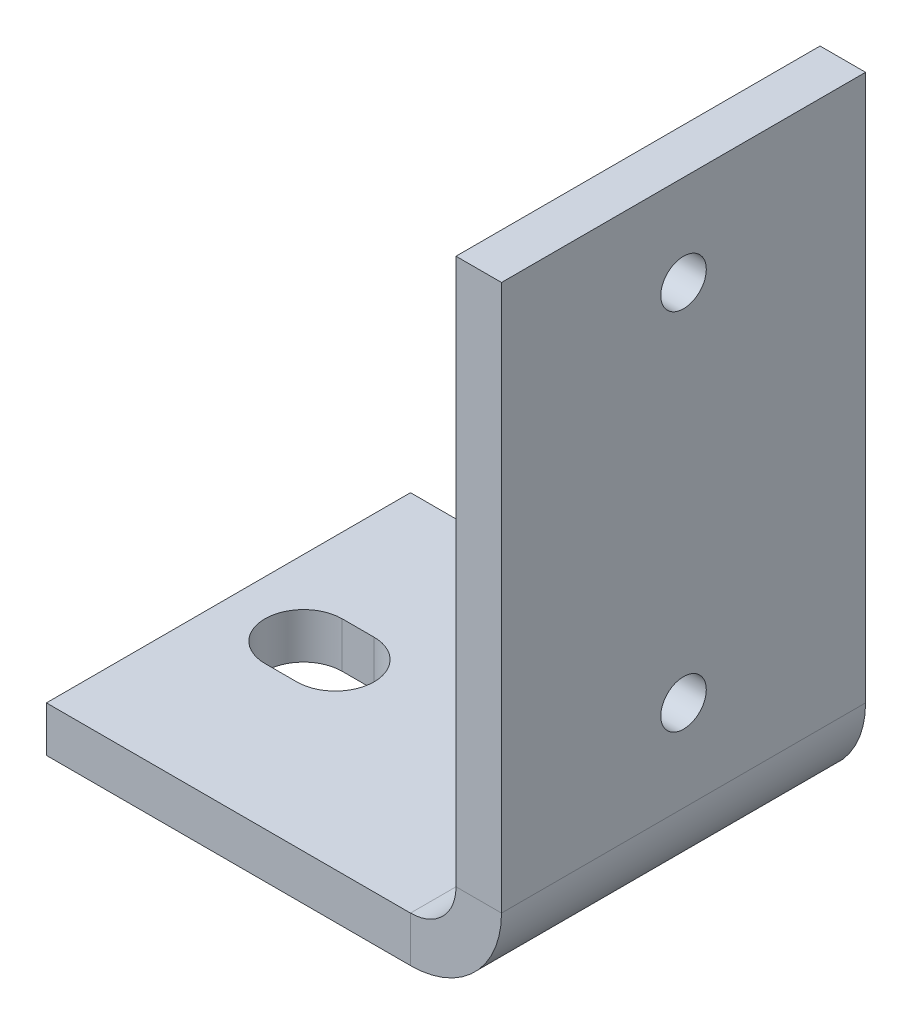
ISO-10303-21;
HEADER;
FILE_DESCRIPTION(('STEP AP214'),'2;1');
FILE_NAME('part.step','',(''),(''),'','','');
FILE_SCHEMA(('AUTOMOTIVE_DESIGN { 1 0 10303 214 1 1 1 1 }'));
ENDSEC;
DATA;
#1=APPLICATION_CONTEXT('core data for automotive mechanical design processes');
#2=APPLICATION_PROTOCOL_DEFINITION('international standard','automotive_design',2000,#1);
#3=PRODUCT_CONTEXT('',#1,'mechanical');
#4=PRODUCT('Part','Part','',(#3));
#5=PRODUCT_RELATED_PRODUCT_CATEGORY('part','',(#4));
#6=PRODUCT_DEFINITION_FORMATION('','',#4);
#7=PRODUCT_DEFINITION_CONTEXT('part definition',#1,'design');
#8=PRODUCT_DEFINITION('design','',#6,#7);
#9=PRODUCT_DEFINITION_SHAPE('','',#8);
#10=(LENGTH_UNIT() NAMED_UNIT(*) SI_UNIT(.MILLI.,.METRE.));
#11=(NAMED_UNIT(*) PLANE_ANGLE_UNIT() SI_UNIT($,.RADIAN.));
#12=(NAMED_UNIT(*) SI_UNIT($,.STERADIAN.) SOLID_ANGLE_UNIT());
#13=UNCERTAINTY_MEASURE_WITH_UNIT(LENGTH_MEASURE(1.E-05),#10,'distance_accuracy_value','');
#14=(GEOMETRIC_REPRESENTATION_CONTEXT(3) GLOBAL_UNCERTAINTY_ASSIGNED_CONTEXT((#13)) GLOBAL_UNIT_ASSIGNED_CONTEXT((#10,
#11,#12)) REPRESENTATION_CONTEXT('',''));
#15=CARTESIAN_POINT('',(0.,0.,0.));
#16=DIRECTION('',(0.,0.,1.));
#17=DIRECTION('',(1.,0.,0.));
#18=AXIS2_PLACEMENT_3D('',#15,#16,#17);
#19=CARTESIAN_POINT('',(-9.99999999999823,-70.0000000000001,20.0000000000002));
#20=DIRECTION('',(0.,0.,1.00000000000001));
#21=DIRECTION('',(1.,0.,0.));
#22=AXIS2_PLACEMENT_3D('',#19,#20,#21);
#23=PLANE('',#22);
#24=DIRECTION('',(0.,1.00000000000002,0.));
#25=VECTOR('',#24,1.);
#26=CARTESIAN_POINT('',(-9.99999999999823,-70.0000000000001,20.0000000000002));
#27=LINE('',#26,#25);
#28=CARTESIAN_POINT('',(-9.99999999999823,-70.0000000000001,20.0000000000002));
#29=VERTEX_POINT('',#28);
#30=CARTESIAN_POINT('',(-9.9999999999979,-64.9999999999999,20.0000000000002));
#31=VERTEX_POINT('',#30);
#32=EDGE_CURVE('E11',#29,#31,#27,.T.);
#33=ORIENTED_EDGE('',*,*,#32,.F.);
#34=CARTESIAN_POINT('',(-9.9999999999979,-60.0000000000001,20.0000000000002));
#35=DIRECTION('',(0.,0.,1.00000000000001));
#36=DIRECTION('',(1.,0.,0.));
#37=AXIS2_PLACEMENT_3D('',#34,#35,#36);
#38=CIRCLE('',#37,10.);
#39=CARTESIAN_POINT('',(2.1094237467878E-12,-60.0000000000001,20.0000000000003));
#40=VERTEX_POINT('',#39);
#41=EDGE_CURVE('E227',#40,#29,#38,.F.);
#42=ORIENTED_EDGE('',*,*,#41,.F.);
#43=DIRECTION('',(1.,0.,0.));
#44=VECTOR('',#43,1.);
#45=CARTESIAN_POINT('',(-4.9999999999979,-60.0000000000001,20.0000000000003));
#46=LINE('',#45,#44);
#47=CARTESIAN_POINT('',(-4.9999999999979,-60.0000000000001,20.0000000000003));
#48=VERTEX_POINT('',#47);
#49=EDGE_CURVE('E55',#48,#40,#46,.T.);
#50=ORIENTED_EDGE('',*,*,#49,.F.);
#51=CARTESIAN_POINT('',(-9.9999999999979,-60.0000000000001,20.0000000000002));
#52=DIRECTION('',(0.,0.,1.00000000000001));
#53=DIRECTION('',(1.,0.,0.));
#54=AXIS2_PLACEMENT_3D('',#51,#52,#53);
#55=CIRCLE('',#54,5.);
#56=EDGE_CURVE('E243',#48,#31,#55,.F.);
#57=ORIENTED_EDGE('',*,*,#56,.T.);
#58=EDGE_LOOP('',(#33,#42,#50,#57));
#59=FACE_BOUND('',#58,.T.);
#60=ADVANCED_FACE('F46',(#59),#23,.T.);
#61=CARTESIAN_POINT('',(-4.9999999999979,-60.0000000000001,20.0000000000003));
#62=DIRECTION('',(0.,0.,1.00000000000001));
#63=DIRECTION('',(1.,0.,0.));
#64=AXIS2_PLACEMENT_3D('',#61,#62,#63);
#65=PLANE('',#64);
#66=DIRECTION('',(-1.,0.,0.));
#67=VECTOR('',#66,1.);
#68=CARTESIAN_POINT('',(2.1094237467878E-12,-70.0000000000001,20.0000000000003));
#69=LINE('',#68,#67);
#70=CARTESIAN_POINT('',(-50.0000000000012,-69.9999999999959,20.0000000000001));
#71=VERTEX_POINT('',#70);
#72=EDGE_CURVE('E223',#29,#71,#69,.T.);
#73=ORIENTED_EDGE('',*,*,#72,.F.);
#74=ORIENTED_EDGE('',*,*,#32,.T.);
#75=DIRECTION('',(1.,0.,0.));
#76=VECTOR('',#75,1.);
#77=CARTESIAN_POINT('',(2.1094237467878E-12,-64.9999999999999,20.0000000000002));
#78=LINE('',#77,#76);
#79=CARTESIAN_POINT('',(-50.0000000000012,-64.9999999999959,20.));
#80=VERTEX_POINT('',#79);
#81=EDGE_CURVE('E216',#31,#80,#78,.F.);
#82=ORIENTED_EDGE('',*,*,#81,.T.);
#83=DIRECTION('',(0.,1.00000000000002,0.));
#84=VECTOR('',#83,1.);
#85=CARTESIAN_POINT('',(-50.0000000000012,-69.9999999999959,20.0000000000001));
#86=LINE('',#85,#84);
#87=EDGE_CURVE('E219',#71,#80,#86,.T.);
#88=ORIENTED_EDGE('',*,*,#87,.F.);
#89=EDGE_LOOP('',(#73,#74,#82,#88));
#90=FACE_BOUND('',#89,.T.);
#91=ADVANCED_FACE('F337',(#90),#65,.T.);
#92=CARTESIAN_POINT('',(4.44089209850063E-13,-60.0000000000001,-19.9999999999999));
#93=DIRECTION('',(0.,0.,-1.00000000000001));
#94=DIRECTION('',(-1.,0.,0.));
#95=AXIS2_PLACEMENT_3D('',#92,#93,#94);
#96=PLANE('',#95);
#97=DIRECTION('',(-1.,0.,0.));
#98=VECTOR('',#97,1.);
#99=CARTESIAN_POINT('',(4.44089209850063E-13,-60.0000000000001,-19.9999999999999));
#100=LINE('',#99,#98);
#101=CARTESIAN_POINT('',(4.44089209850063E-13,-60.0000000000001,-19.9999999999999));
#102=VERTEX_POINT('',#101);
#103=CARTESIAN_POINT('',(-4.99999999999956,-60.0000000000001,-19.9999999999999));
#104=VERTEX_POINT('',#103);
#105=EDGE_CURVE('E277',#102,#104,#100,.T.);
#106=ORIENTED_EDGE('',*,*,#105,.F.);
#107=CARTESIAN_POINT('',(-9.99999999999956,-60.0000000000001,-20.));
#108=DIRECTION('',(0.,0.,1.00000000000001));
#109=DIRECTION('',(1.,0.,0.));
#110=AXIS2_PLACEMENT_3D('',#107,#108,#109);
#111=CIRCLE('',#110,10.);
#112=CARTESIAN_POINT('',(-9.99999999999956,-70.0000000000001,-20.));
#113=VERTEX_POINT('',#112);
#114=EDGE_CURVE('E196',#102,#113,#111,.F.);
#115=ORIENTED_EDGE('',*,*,#114,.T.);
#116=DIRECTION('',(0.,-1.00000000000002,0.));
#117=VECTOR('',#116,1.);
#118=CARTESIAN_POINT('',(-9.99999999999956,-65.0000000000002,-20.));
#119=LINE('',#118,#117);
#120=CARTESIAN_POINT('',(-9.99999999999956,-65.0000000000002,-20.));
#121=VERTEX_POINT('',#120);
#122=EDGE_CURVE('E274',#121,#113,#119,.T.);
#123=ORIENTED_EDGE('',*,*,#122,.F.);
#124=CARTESIAN_POINT('',(-9.99999999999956,-60.0000000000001,-20.));
#125=DIRECTION('',(0.,0.,1.00000000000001));
#126=DIRECTION('',(1.,0.,0.));
#127=AXIS2_PLACEMENT_3D('',#124,#125,#126);
#128=CIRCLE('',#127,5.);
#129=EDGE_CURVE('E212',#104,#121,#128,.F.);
#130=ORIENTED_EDGE('',*,*,#129,.F.);
#131=EDGE_LOOP('',(#106,#115,#123,#130));
#132=FACE_BOUND('',#131,.T.);
#133=ADVANCED_FACE('F348',(#132),#96,.T.);
#134=CARTESIAN_POINT('',(-9.99999999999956,-65.0000000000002,-20.));
#135=DIRECTION('',(0.,0.,-1.00000000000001));
#136=DIRECTION('',(-1.,0.,0.));
#137=AXIS2_PLACEMENT_3D('',#134,#135,#136);
#138=PLANE('',#137);
#139=DIRECTION('',(0.,-1.00000000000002,0.));
#140=VECTOR('',#139,1.);
#141=CARTESIAN_POINT('',(0.,0.,-20.0000000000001));
#142=LINE('',#141,#140);
#143=CARTESIAN_POINT('',(0.,0.,-20.0000000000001));
#144=VERTEX_POINT('',#143);
#145=EDGE_CURVE('E200',#144,#102,#142,.T.);
#146=ORIENTED_EDGE('',*,*,#145,.T.);
#147=ORIENTED_EDGE('',*,*,#105,.T.);
#148=DIRECTION('',(0.,-1.00000000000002,0.));
#149=VECTOR('',#148,1.);
#150=CARTESIAN_POINT('',(-4.99999999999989,0.,-20.0000000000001));
#151=LINE('',#150,#149);
#152=CARTESIAN_POINT('',(-4.99999999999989,0.,-20.0000000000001));
#153=VERTEX_POINT('',#152);
#154=EDGE_CURVE('E208',#153,#104,#151,.T.);
#155=ORIENTED_EDGE('',*,*,#154,.F.);
#156=DIRECTION('',(1.,0.,0.));
#157=VECTOR('',#156,1.);
#158=CARTESIAN_POINT('',(-4.99999999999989,0.,-20.0000000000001));
#159=LINE('',#158,#157);
#160=EDGE_CURVE('E204',#153,#144,#159,.T.);
#161=ORIENTED_EDGE('',*,*,#160,.T.);
#162=EDGE_LOOP('',(#146,#147,#155,#161));
#163=FACE_BOUND('',#162,.T.);
#164=ADVANCED_FACE('F318',(#163),#138,.T.);
#165=CARTESIAN_POINT('',(2.1094237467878E-12,-64.9999999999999,20.0000000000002));
#166=DIRECTION('',(0.,-1.00000000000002,0.));
#167=DIRECTION('',(0.,0.,-1.00000000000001));
#168=AXIS2_PLACEMENT_3D('',#165,#166,#167);
#169=PLANE('',#168);
#170=DIRECTION('',(-1.,0.,0.));
#171=VECTOR('',#170,1.);
#172=CARTESIAN_POINT('',(-41.7500000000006,-64.9999999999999,-4.24999999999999));
#173=LINE('',#172,#171);
#174=CARTESIAN_POINT('',(-38.2500000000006,-64.9999999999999,-4.24999999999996));
#175=VERTEX_POINT('',#174);
#176=CARTESIAN_POINT('',(-41.7500000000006,-64.9999999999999,-4.24999999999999));
#177=VERTEX_POINT('',#176);
#178=EDGE_CURVE('E158',#175,#177,#173,.T.);
#179=ORIENTED_EDGE('',*,*,#178,.F.);
#180=CARTESIAN_POINT('',(-38.2500000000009,-64.9999999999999,0.));
#181=DIRECTION('',(0.,-1.00000000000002,0.));
#182=DIRECTION('',(0.,0.,-1.00000000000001));
#183=AXIS2_PLACEMENT_3D('',#180,#181,#182);
#184=CIRCLE('',#183,4.24999999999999);
#185=CARTESIAN_POINT('',(-38.250000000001,-65.0000000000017,4.25000000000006));
#186=VERTEX_POINT('',#185);
#187=EDGE_CURVE('E138',#186,#175,#184,.F.);
#188=ORIENTED_EDGE('',*,*,#187,.F.);
#189=DIRECTION('',(1.,0.,0.));
#190=VECTOR('',#189,1.);
#191=CARTESIAN_POINT('',(-38.250000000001,-65.0000000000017,4.25000000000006));
#192=LINE('',#191,#190);
#193=CARTESIAN_POINT('',(-41.7500000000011,-65.0000000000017,4.25000000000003));
#194=VERTEX_POINT('',#193);
#195=EDGE_CURVE('E148',#194,#186,#192,.T.);
#196=ORIENTED_EDGE('',*,*,#195,.F.);
#197=CARTESIAN_POINT('',(-41.7500000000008,-65.0000000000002,0.));
#198=DIRECTION('',(0.,-1.00000000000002,0.));
#199=DIRECTION('',(0.,0.,-1.00000000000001));
#200=AXIS2_PLACEMENT_3D('',#197,#198,#199);
#201=CIRCLE('',#200,4.24999999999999);
#202=EDGE_CURVE('E63',#177,#194,#201,.F.);
#203=ORIENTED_EDGE('',*,*,#202,.F.);
#204=EDGE_LOOP('',(#179,#188,#196,#203));
#205=FACE_BOUND('',#204,.T.);
#206=DIRECTION('',(1.,0.,0.));
#207=VECTOR('',#206,1.);
#208=CARTESIAN_POINT('',(4.44089209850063E-13,-65.0000000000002,-20.));
#209=LINE('',#208,#207);
#210=CARTESIAN_POINT('',(-50.0000000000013,-65.0000000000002,-20.0000000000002));
#211=VERTEX_POINT('',#210);
#212=EDGE_CURVE('E152',#121,#211,#209,.F.);
#213=ORIENTED_EDGE('',*,*,#212,.T.);
#214=DIRECTION('',(0.,0.,-1.00000000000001));
#215=VECTOR('',#214,1.);
#216=CARTESIAN_POINT('',(-50.0000000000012,-64.9999999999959,20.));
#217=LINE('',#216,#215);
#218=EDGE_CURVE('E271',#80,#211,#217,.T.);
#219=ORIENTED_EDGE('',*,*,#218,.F.);
#220=ORIENTED_EDGE('',*,*,#81,.F.);
#221=DIRECTION('',(0.,0.,-1.00000000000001));
#222=VECTOR('',#221,1.);
#223=CARTESIAN_POINT('',(-9.9999999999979,-64.9999999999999,20.0000000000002));
#224=LINE('',#223,#222);
#225=EDGE_CURVE('E247',#31,#121,#224,.T.);
#226=ORIENTED_EDGE('',*,*,#225,.T.);
#227=EDGE_LOOP('',(#213,#219,#220,#226));
#228=FACE_BOUND('',#227,.T.);
#229=ADVANCED_FACE('F155',(#205,#228),#169,.F.);
#230=CARTESIAN_POINT('',(-50.0000000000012,-69.9999999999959,20.0000000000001));
#231=DIRECTION('',(-1.,0.,0.));
#232=DIRECTION('',(0.,0.,1.00000000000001));
#233=AXIS2_PLACEMENT_3D('',#230,#231,#232);
#234=PLANE('',#233);
#235=DIRECTION('',(0.,1.00000000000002,0.));
#236=VECTOR('',#235,1.);
#237=CARTESIAN_POINT('',(-50.0000000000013,-70.0000000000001,-20.0000000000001));
#238=LINE('',#237,#236);
#239=CARTESIAN_POINT('',(-50.0000000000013,-70.0000000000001,-20.0000000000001));
#240=VERTEX_POINT('',#239);
#241=EDGE_CURVE('E188',#240,#211,#238,.T.);
#242=ORIENTED_EDGE('',*,*,#241,.F.);
#243=DIRECTION('',(0.,0.,-1.00000000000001));
#244=VECTOR('',#243,1.);
#245=CARTESIAN_POINT('',(-50.0000000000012,-69.9999999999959,20.0000000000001));
#246=LINE('',#245,#244);
#247=EDGE_CURVE('E268',#71,#240,#246,.T.);
#248=ORIENTED_EDGE('',*,*,#247,.F.);
#249=ORIENTED_EDGE('',*,*,#87,.T.);
#250=ORIENTED_EDGE('',*,*,#218,.T.);
#251=EDGE_LOOP('',(#242,#248,#249,#250));
#252=FACE_BOUND('',#251,.T.);
#253=ADVANCED_FACE('F342',(#252),#234,.T.);
#254=CARTESIAN_POINT('',(2.1094237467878E-12,-70.0000000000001,20.0000000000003));
#255=DIRECTION('',(0.,-1.00000000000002,0.));
#256=DIRECTION('',(0.,0.,-1.00000000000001));
#257=AXIS2_PLACEMENT_3D('',#254,#255,#256);
#258=PLANE('',#257);
#259=CARTESIAN_POINT('',(-38.2500000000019,-69.9999999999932,0.));
#260=DIRECTION('',(0.,-1.00000000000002,0.));
#261=DIRECTION('',(0.,0.,-1.00000000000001));
#262=AXIS2_PLACEMENT_3D('',#259,#260,#261);
#263=CIRCLE('',#262,4.24999999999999);
#264=CARTESIAN_POINT('',(-38.2500000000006,-69.9999999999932,-4.24999999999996));
#265=VERTEX_POINT('',#264);
#266=CARTESIAN_POINT('',(-38.250000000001,-70.0000000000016,4.25000000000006));
#267=VERTEX_POINT('',#266);
#268=EDGE_CURVE('E71',#265,#267,#263,.T.);
#269=ORIENTED_EDGE('',*,*,#268,.F.);
#270=DIRECTION('',(1.,0.,0.));
#271=VECTOR('',#270,1.);
#272=CARTESIAN_POINT('',(-41.7500000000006,-69.9999999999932,-4.24999999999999));
#273=LINE('',#272,#271);
#274=CARTESIAN_POINT('',(-41.7500000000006,-69.9999999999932,-4.24999999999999));
#275=VERTEX_POINT('',#274);
#276=EDGE_CURVE('E145',#275,#265,#273,.T.);
#277=ORIENTED_EDGE('',*,*,#276,.F.);
#278=CARTESIAN_POINT('',(-41.7500000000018,-69.9999999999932,0.));
#279=DIRECTION('',(0.,-1.00000000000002,0.));
#280=DIRECTION('',(0.,0.,-1.00000000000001));
#281=AXIS2_PLACEMENT_3D('',#278,#279,#280);
#282=CIRCLE('',#281,4.24999999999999);
#283=CARTESIAN_POINT('',(-41.7500000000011,-69.9999999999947,4.25000000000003));
#284=VERTEX_POINT('',#283);
#285=EDGE_CURVE('E172',#284,#275,#282,.T.);
#286=ORIENTED_EDGE('',*,*,#285,.F.);
#287=DIRECTION('',(-1.,0.,0.));
#288=VECTOR('',#287,1.);
#289=CARTESIAN_POINT('',(-38.250000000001,-69.9999999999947,4.25000000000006));
#290=LINE('',#289,#288);
#291=EDGE_CURVE('E164',#267,#284,#290,.T.);
#292=ORIENTED_EDGE('',*,*,#291,.F.);
#293=EDGE_LOOP('',(#269,#277,#286,#292));
#294=FACE_BOUND('',#293,.T.);
#295=DIRECTION('',(-1.,0.,0.));
#296=VECTOR('',#295,1.);
#297=CARTESIAN_POINT('',(4.44089209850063E-13,-70.0000000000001,-19.9999999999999));
#298=LINE('',#297,#296);
#299=EDGE_CURVE('E192',#113,#240,#298,.T.);
#300=ORIENTED_EDGE('',*,*,#299,.F.);
#301=DIRECTION('',(0.,0.,-1.00000000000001));
#302=VECTOR('',#301,1.);
#303=CARTESIAN_POINT('',(-9.99999999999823,-70.0000000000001,20.0000000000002));
#304=LINE('',#303,#302);
#305=EDGE_CURVE('E264',#29,#113,#304,.T.);
#306=ORIENTED_EDGE('',*,*,#305,.F.);
#307=ORIENTED_EDGE('',*,*,#72,.T.);
#308=ORIENTED_EDGE('',*,*,#247,.T.);
#309=EDGE_LOOP('',(#300,#306,#307,#308));
#310=FACE_BOUND('',#309,.T.);
#311=ADVANCED_FACE('F335',(#294,#310),#258,.T.);
#312=CARTESIAN_POINT('',(-9.9999999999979,-60.0000000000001,20.0000000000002));
#313=DIRECTION('',(0.,0.,-1.00000000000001));
#314=DIRECTION('',(-1.,0.,0.));
#315=AXIS2_PLACEMENT_3D('',#312,#313,#314);
#316=CYLINDRICAL_SURFACE('',#315,10.);
#317=ORIENTED_EDGE('',*,*,#114,.F.);
#318=DIRECTION('',(0.,0.,-1.00000000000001));
#319=VECTOR('',#318,1.);
#320=CARTESIAN_POINT('',(2.1094237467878E-12,-60.0000000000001,20.0000000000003));
#321=LINE('',#320,#319);
#322=EDGE_CURVE('E260',#40,#102,#321,.T.);
#323=ORIENTED_EDGE('',*,*,#322,.F.);
#324=ORIENTED_EDGE('',*,*,#41,.T.);
#325=ORIENTED_EDGE('',*,*,#305,.T.);
#326=EDGE_LOOP('',(#317,#323,#324,#325));
#327=FACE_BOUND('',#326,.T.);
#328=ADVANCED_FACE('F308',(#327),#316,.T.);
#329=CARTESIAN_POINT('',(-1.88737914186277E-12,0.,20.0000000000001));
#330=DIRECTION('',(1.,0.,0.));
#331=DIRECTION('',(0.,1.00000000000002,0.));
#332=AXIS2_PLACEMENT_3D('',#329,#330,#331);
#333=PLANE('',#332);
#334=CARTESIAN_POINT('',(0.,-10.,0.));
#335=DIRECTION('',(1.,0.,0.));
#336=DIRECTION('',(0.,0.,-1.00000000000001));
#337=AXIS2_PLACEMENT_3D('',#334,#335,#336);
#338=CIRCLE('',#337,2.49999999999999);
#339=CARTESIAN_POINT('',(0.,-10.,-2.49999999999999));
#340=VERTEX_POINT('',#339);
#341=EDGE_CURVE('E295',#340,#340,#338,.T.);
#342=ORIENTED_EDGE('',*,*,#341,.F.);
#343=EDGE_LOOP('',(#342));
#344=FACE_BOUND('',#343,.T.);
#345=CARTESIAN_POINT('',(4.44089209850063E-13,-50.,1.11022302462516E-13));
#346=DIRECTION('',(1.,0.,0.));
#347=DIRECTION('',(0.,0.,-1.00000000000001));
#348=AXIS2_PLACEMENT_3D('',#345,#346,#347);
#349=CIRCLE('',#348,2.49999999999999);
#350=CARTESIAN_POINT('',(4.3692784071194E-13,-50.,-2.49999999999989));
#351=VERTEX_POINT('',#350);
#352=EDGE_CURVE('E284',#351,#351,#349,.T.);
#353=ORIENTED_EDGE('',*,*,#352,.F.);
#354=EDGE_LOOP('',(#353));
#355=FACE_BOUND('',#354,.T.);
#356=ORIENTED_EDGE('',*,*,#145,.F.);
#357=DIRECTION('',(0.,0.,-1.00000000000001));
#358=VECTOR('',#357,1.);
#359=CARTESIAN_POINT('',(-1.88737914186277E-12,0.,20.0000000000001));
#360=LINE('',#359,#358);
#361=CARTESIAN_POINT('',(-1.88737914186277E-12,0.,20.0000000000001));
#362=VERTEX_POINT('',#361);
#363=EDGE_CURVE('E257',#362,#144,#360,.T.);
#364=ORIENTED_EDGE('',*,*,#363,.F.);
#365=DIRECTION('',(0.,-1.00000000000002,0.));
#366=VECTOR('',#365,1.);
#367=CARTESIAN_POINT('',(-1.88737914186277E-12,0.,20.0000000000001));
#368=LINE('',#367,#366);
#369=EDGE_CURVE('E231',#362,#40,#368,.T.);
#370=ORIENTED_EDGE('',*,*,#369,.T.);
#371=ORIENTED_EDGE('',*,*,#322,.T.);
#372=EDGE_LOOP('',(#356,#364,#370,#371));
#373=FACE_BOUND('',#372,.T.);
#374=ADVANCED_FACE('F304',(#344,#355,#373),#333,.T.);
#375=CARTESIAN_POINT('',(-5.00000000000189,0.,20.0000000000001));
#376=DIRECTION('',(0.,1.00000000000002,0.));
#377=DIRECTION('',(-1.,0.,0.));
#378=AXIS2_PLACEMENT_3D('',#375,#376,#377);
#379=PLANE('',#378);
#380=ORIENTED_EDGE('',*,*,#160,.F.);
#381=DIRECTION('',(0.,0.,-1.00000000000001));
#382=VECTOR('',#381,1.);
#383=CARTESIAN_POINT('',(-5.00000000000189,0.,20.0000000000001));
#384=LINE('',#383,#382);
#385=CARTESIAN_POINT('',(-5.00000000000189,0.,20.0000000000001));
#386=VERTEX_POINT('',#385);
#387=EDGE_CURVE('E254',#386,#153,#384,.T.);
#388=ORIENTED_EDGE('',*,*,#387,.F.);
#389=DIRECTION('',(1.,0.,0.));
#390=VECTOR('',#389,1.);
#391=CARTESIAN_POINT('',(-5.00000000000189,0.,20.0000000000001));
#392=LINE('',#391,#390);
#393=EDGE_CURVE('E235',#386,#362,#392,.T.);
#394=ORIENTED_EDGE('',*,*,#393,.T.);
#395=ORIENTED_EDGE('',*,*,#363,.T.);
#396=EDGE_LOOP('',(#380,#388,#394,#395));
#397=FACE_BOUND('',#396,.T.);
#398=ADVANCED_FACE('F307',(#397),#379,.T.);
#399=CARTESIAN_POINT('',(-5.00000000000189,0.,20.0000000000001));
#400=DIRECTION('',(1.,0.,0.));
#401=DIRECTION('',(0.,1.00000000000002,0.));
#402=AXIS2_PLACEMENT_3D('',#399,#400,#401);
#403=PLANE('',#402);
#404=CARTESIAN_POINT('',(-5.,-10.,0.));
#405=DIRECTION('',(1.,0.,0.));
#406=DIRECTION('',(0.,1.00000000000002,0.));
#407=AXIS2_PLACEMENT_3D('',#404,#405,#406);
#408=CIRCLE('',#407,2.49999999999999);
#409=CARTESIAN_POINT('',(-5.,-7.49999999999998,0.));
#410=VERTEX_POINT('',#409);
#411=EDGE_CURVE('E49',#410,#410,#408,.T.);
#412=ORIENTED_EDGE('',*,*,#411,.T.);
#413=EDGE_LOOP('',(#412));
#414=FACE_BOUND('',#413,.T.);
#415=CARTESIAN_POINT('',(-4.99999999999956,-50.,0.));
#416=DIRECTION('',(1.,0.,0.));
#417=DIRECTION('',(0.,1.00000000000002,0.));
#418=AXIS2_PLACEMENT_3D('',#415,#416,#417);
#419=CIRCLE('',#418,2.49999999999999);
#420=CARTESIAN_POINT('',(-4.99999999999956,-47.5,0.));
#421=VERTEX_POINT('',#420);
#422=EDGE_CURVE('E281',#421,#421,#419,.T.);
#423=ORIENTED_EDGE('',*,*,#422,.T.);
#424=EDGE_LOOP('',(#423));
#425=FACE_BOUND('',#424,.T.);
#426=ORIENTED_EDGE('',*,*,#154,.T.);
#427=DIRECTION('',(0.,0.,-1.00000000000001));
#428=VECTOR('',#427,1.);
#429=CARTESIAN_POINT('',(-4.9999999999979,-60.0000000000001,20.0000000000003));
#430=LINE('',#429,#428);
#431=EDGE_CURVE('E251',#48,#104,#430,.T.);
#432=ORIENTED_EDGE('',*,*,#431,.F.);
#433=DIRECTION('',(0.,-1.00000000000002,0.));
#434=VECTOR('',#433,1.);
#435=CARTESIAN_POINT('',(-5.00000000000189,0.,20.0000000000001));
#436=LINE('',#435,#434);
#437=EDGE_CURVE('E239',#386,#48,#436,.T.);
#438=ORIENTED_EDGE('',*,*,#437,.F.);
#439=ORIENTED_EDGE('',*,*,#387,.T.);
#440=EDGE_LOOP('',(#426,#432,#438,#439));
#441=FACE_BOUND('',#440,.T.);
#442=ADVANCED_FACE('F409',(#414,#425,#441),#403,.F.);
#443=CARTESIAN_POINT('',(-9.9999999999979,-60.0000000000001,20.0000000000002));
#444=DIRECTION('',(0.,0.,-1.00000000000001));
#445=DIRECTION('',(-1.,0.,0.));
#446=AXIS2_PLACEMENT_3D('',#443,#444,#445);
#447=CYLINDRICAL_SURFACE('',#446,5.);
#448=ORIENTED_EDGE('',*,*,#129,.T.);
#449=ORIENTED_EDGE('',*,*,#225,.F.);
#450=ORIENTED_EDGE('',*,*,#56,.F.);
#451=ORIENTED_EDGE('',*,*,#431,.T.);
#452=EDGE_LOOP('',(#448,#449,#450,#451));
#453=FACE_BOUND('',#452,.T.);
#454=ADVANCED_FACE('F350',(#453),#447,.F.);
#455=CARTESIAN_POINT('',(-9.9999999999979,-60.0000000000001,20.0000000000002));
#456=DIRECTION('',(0.,0.,1.00000000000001));
#457=DIRECTION('',(1.,0.,0.));
#458=AXIS2_PLACEMENT_3D('',#455,#456,#457);
#459=PLANE('',#458);
#460=ORIENTED_EDGE('',*,*,#437,.T.);
#461=ORIENTED_EDGE('',*,*,#49,.T.);
#462=ORIENTED_EDGE('',*,*,#369,.F.);
#463=ORIENTED_EDGE('',*,*,#393,.F.);
#464=EDGE_LOOP('',(#460,#461,#462,#463));
#465=FACE_BOUND('',#464,.T.);
#466=ADVANCED_FACE('F323',(#465),#459,.T.);
#467=CARTESIAN_POINT('',(-9.99999999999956,-60.0000000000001,-20.));
#468=DIRECTION('',(0.,0.,1.00000000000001));
#469=DIRECTION('',(1.,0.,0.));
#470=AXIS2_PLACEMENT_3D('',#467,#468,#469);
#471=PLANE('',#470);
#472=ORIENTED_EDGE('',*,*,#212,.F.);
#473=ORIENTED_EDGE('',*,*,#122,.T.);
#474=ORIENTED_EDGE('',*,*,#299,.T.);
#475=ORIENTED_EDGE('',*,*,#241,.T.);
#476=EDGE_LOOP('',(#472,#473,#474,#475));
#477=FACE_BOUND('',#476,.T.);
#478=ADVANCED_FACE('F345',(#477),#471,.F.);
#479=CARTESIAN_POINT('',(-38.2500000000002,0.00100000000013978,-1.11022302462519E-13));
#480=DIRECTION('',(0.,-1.00000000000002,0.));
#481=DIRECTION('',(0.,0.,-1.00000000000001));
#482=AXIS2_PLACEMENT_3D('',#479,#480,#481);
#483=CYLINDRICAL_SURFACE('',#482,4.24999999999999);
#484=ORIENTED_EDGE('',*,*,#187,.T.);
#485=DIRECTION('',(0.,-1.00000000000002,0.));
#486=VECTOR('',#485,1.);
#487=CARTESIAN_POINT('',(-38.2500000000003,0.00100000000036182,-4.25000000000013));
#488=LINE('',#487,#486);
#489=EDGE_CURVE('E153',#175,#265,#488,.T.);
#490=ORIENTED_EDGE('',*,*,#489,.T.);
#491=ORIENTED_EDGE('',*,*,#268,.T.);
#492=DIRECTION('',(0.,-1.00000000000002,0.));
#493=VECTOR('',#492,1.);
#494=CARTESIAN_POINT('',(-38.2500000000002,0.00100000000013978,4.24999999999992));
#495=LINE('',#494,#493);
#496=EDGE_CURVE('E134',#186,#267,#495,.T.);
#497=ORIENTED_EDGE('',*,*,#496,.F.);
#498=EDGE_LOOP('',(#484,#490,#491,#497));
#499=FACE_BOUND('',#498,.T.);
#500=ADVANCED_FACE('F136',(#499),#483,.F.);
#501=CARTESIAN_POINT('',(-41.7500000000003,0.00100000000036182,-4.25000000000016));
#502=DIRECTION('',(0.,0.,-1.00000000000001));
#503=DIRECTION('',(-1.,0.,0.));
#504=AXIS2_PLACEMENT_3D('',#501,#502,#503);
#505=PLANE('',#504);
#506=ORIENTED_EDGE('',*,*,#178,.T.);
#507=DIRECTION('',(0.,-1.00000000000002,0.));
#508=VECTOR('',#507,1.);
#509=CARTESIAN_POINT('',(-41.7500000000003,0.00100000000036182,-4.25000000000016));
#510=LINE('',#509,#508);
#511=EDGE_CURVE('E180',#177,#275,#510,.T.);
#512=ORIENTED_EDGE('',*,*,#511,.T.);
#513=ORIENTED_EDGE('',*,*,#276,.T.);
#514=ORIENTED_EDGE('',*,*,#489,.F.);
#515=EDGE_LOOP('',(#506,#512,#513,#514));
#516=FACE_BOUND('',#515,.T.);
#517=ADVANCED_FACE('F446',(#516),#505,.F.);
#518=CARTESIAN_POINT('',(-41.7500000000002,0.00100000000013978,-1.24900090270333E-13));
#519=DIRECTION('',(0.,-1.00000000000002,0.));
#520=DIRECTION('',(0.,0.,-1.00000000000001));
#521=AXIS2_PLACEMENT_3D('',#518,#519,#520);
#522=CYLINDRICAL_SURFACE('',#521,4.24999999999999);
#523=ORIENTED_EDGE('',*,*,#202,.T.);
#524=DIRECTION('',(0.,-1.00000000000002,0.));
#525=VECTOR('',#524,1.);
#526=CARTESIAN_POINT('',(-41.7500000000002,0.00100000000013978,4.24999999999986));
#527=LINE('',#526,#525);
#528=EDGE_CURVE('E144',#194,#284,#527,.T.);
#529=ORIENTED_EDGE('',*,*,#528,.T.);
#530=ORIENTED_EDGE('',*,*,#285,.T.);
#531=ORIENTED_EDGE('',*,*,#511,.F.);
#532=EDGE_LOOP('',(#523,#529,#530,#531));
#533=FACE_BOUND('',#532,.T.);
#534=ADVANCED_FACE('F454',(#533),#522,.F.);
#535=CARTESIAN_POINT('',(-38.2500000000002,0.00100000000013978,4.24999999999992));
#536=DIRECTION('',(0.,0.,1.00000000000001));
#537=DIRECTION('',(1.,0.,0.));
#538=AXIS2_PLACEMENT_3D('',#535,#536,#537);
#539=PLANE('',#538);
#540=ORIENTED_EDGE('',*,*,#195,.T.);
#541=ORIENTED_EDGE('',*,*,#496,.T.);
#542=ORIENTED_EDGE('',*,*,#291,.T.);
#543=ORIENTED_EDGE('',*,*,#528,.F.);
#544=EDGE_LOOP('',(#540,#541,#542,#543));
#545=FACE_BOUND('',#544,.T.);
#546=ADVANCED_FACE('F149',(#545),#539,.F.);
#547=CARTESIAN_POINT('',(4.44089209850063E-13,-50.,1.11022302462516E-13));
#548=DIRECTION('',(1.,0.,0.));
#549=DIRECTION('',(0.,0.,-1.00000000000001));
#550=AXIS2_PLACEMENT_3D('',#547,#548,#549);
#551=CYLINDRICAL_SURFACE('',#550,2.49999999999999);
#552=ORIENTED_EDGE('',*,*,#352,.T.);
#553=EDGE_LOOP('',(#552));
#554=FACE_BOUND('',#553,.T.);
#555=ORIENTED_EDGE('',*,*,#422,.F.);
#556=EDGE_LOOP('',(#555));
#557=FACE_BOUND('',#556,.T.);
#558=ADVANCED_FACE('F470',(#554,#557),#551,.F.);
#559=CARTESIAN_POINT('',(0.,-10.,0.));
#560=DIRECTION('',(1.,0.,0.));
#561=DIRECTION('',(0.,0.,-1.00000000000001));
#562=AXIS2_PLACEMENT_3D('',#559,#560,#561);
#563=CYLINDRICAL_SURFACE('',#562,2.49999999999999);
#564=ORIENTED_EDGE('',*,*,#341,.T.);
#565=EDGE_LOOP('',(#564));
#566=FACE_BOUND('',#565,.T.);
#567=ORIENTED_EDGE('',*,*,#411,.F.);
#568=EDGE_LOOP('',(#567));
#569=FACE_BOUND('',#568,.T.);
#570=ADVANCED_FACE('F301',(#566,#569),#563,.F.);
#571=CLOSED_SHELL('',(#60,#91,#133,#164,#229,#253,#311,#328,#374,#398,#442,#454,#466,#478,#500,
#517,#534,#546,#558,#570));
#572=MANIFOLD_SOLID_BREP('B2',#571);
#573=ADVANCED_BREP_SHAPE_REPRESENTATION('',(#18,#572),#14);
#574=SHAPE_DEFINITION_REPRESENTATION(#9,#573);
ENDSEC;
END-ISO-10303-21;
